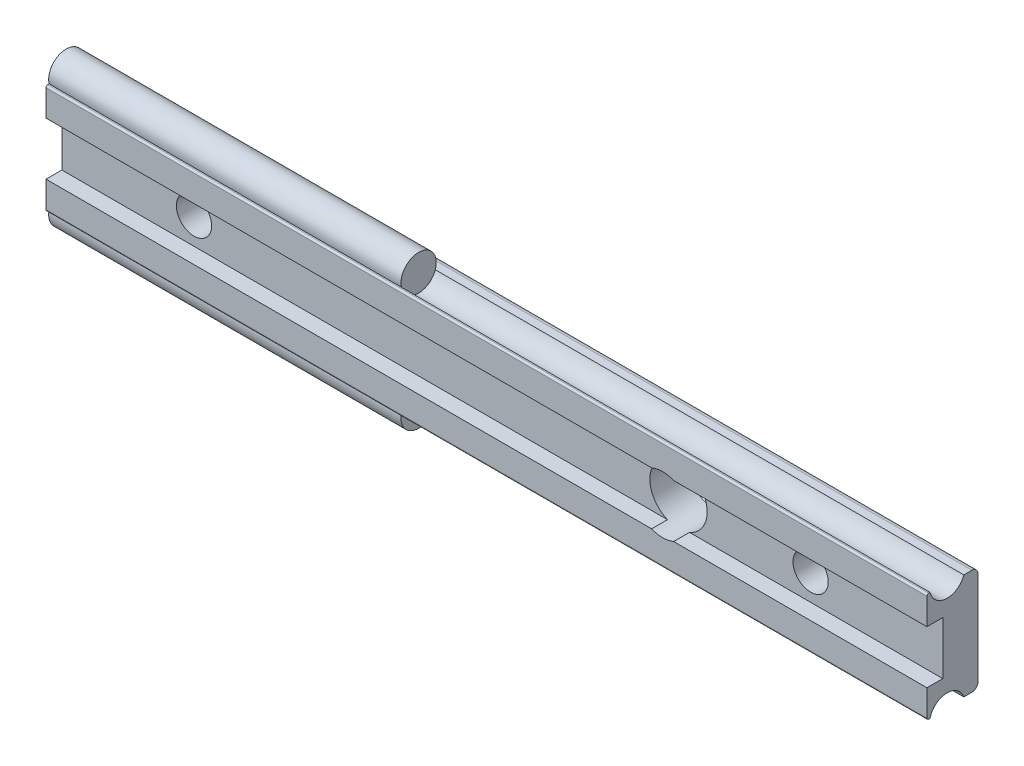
ISO-10303-21;
HEADER;
FILE_DESCRIPTION(('STEP AP214'),'2;1');
FILE_NAME('part.step','',(''),(''),'','','');
FILE_SCHEMA(('AUTOMOTIVE_DESIGN { 1 0 10303 214 1 1 1 1 }'));
ENDSEC;
DATA;
#1=APPLICATION_CONTEXT('core data for automotive mechanical design processes');
#2=APPLICATION_PROTOCOL_DEFINITION('international standard','automotive_design',2000,#1);
#3=PRODUCT_CONTEXT('',#1,'mechanical');
#4=PRODUCT('Part','Part','',(#3));
#5=PRODUCT_RELATED_PRODUCT_CATEGORY('part','',(#4));
#6=PRODUCT_DEFINITION_FORMATION('','',#4);
#7=PRODUCT_DEFINITION_CONTEXT('part definition',#1,'design');
#8=PRODUCT_DEFINITION('design','',#6,#7);
#9=PRODUCT_DEFINITION_SHAPE('','',#8);
#10=(LENGTH_UNIT() NAMED_UNIT(*) SI_UNIT(.MILLI.,.METRE.));
#11=(NAMED_UNIT(*) PLANE_ANGLE_UNIT() SI_UNIT($,.RADIAN.));
#12=(NAMED_UNIT(*) SI_UNIT($,.STERADIAN.) SOLID_ANGLE_UNIT());
#13=UNCERTAINTY_MEASURE_WITH_UNIT(LENGTH_MEASURE(1.E-05),#10,'distance_accuracy_value','');
#14=(GEOMETRIC_REPRESENTATION_CONTEXT(3) GLOBAL_UNCERTAINTY_ASSIGNED_CONTEXT((#13)) GLOBAL_UNIT_ASSIGNED_CONTEXT((#10,
#11,#12)) REPRESENTATION_CONTEXT('',''));
#15=CARTESIAN_POINT('',(0.,0.,0.));
#16=DIRECTION('',(0.,0.,1.));
#17=DIRECTION('',(1.,0.,0.));
#18=AXIS2_PLACEMENT_3D('',#15,#16,#17);
#19=CARTESIAN_POINT('',(-15.,-6.65000008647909,3.5000001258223));
#20=DIRECTION('',(1.,0.,0.));
#21=DIRECTION('',(0.,0.,-1.));
#22=AXIS2_PLACEMENT_3D('',#19,#20,#21);
#23=CYLINDRICAL_SURFACE('',#22,2.00000010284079);
#24=DIRECTION('',(1.,0.,0.));
#25=VECTOR('',#24,1.);
#26=CARTESIAN_POINT('',(-15.,-6.19000011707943,5.4463814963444));
#27=LINE('',#26,#25);
#28=CARTESIAN_POINT('',(25.,-6.19000011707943,5.4463814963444));
#29=VERTEX_POINT('',#28);
#30=CARTESIAN_POINT('',(85.,-6.19000011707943,5.4463814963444));
#31=VERTEX_POINT('',#30);
#32=EDGE_CURVE('E36',#29,#31,#27,.T.);
#33=ORIENTED_EDGE('',*,*,#32,.F.);
#34=CARTESIAN_POINT('',(25.,-6.65000008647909,3.5000001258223));
#35=DIRECTION('',(-1.,0.,0.));
#36=DIRECTION('',(0.,0.,1.));
#37=AXIS2_PLACEMENT_3D('',#34,#35,#36);
#38=CIRCLE('',#37,2.00000010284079);
#39=CARTESIAN_POINT('',(25.,-6.00000004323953,1.60857199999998));
#40=VERTEX_POINT('',#39);
#41=EDGE_CURVE('E31',#29,#40,#38,.T.);
#42=ORIENTED_EDGE('',*,*,#41,.T.);
#43=DIRECTION('',(1.,0.,0.));
#44=VECTOR('',#43,1.);
#45=CARTESIAN_POINT('',(-15.,-6.00000004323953,1.60857199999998));
#46=LINE('',#45,#44);
#47=CARTESIAN_POINT('',(85.,-6.00000004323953,1.60857199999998));
#48=VERTEX_POINT('',#47);
#49=EDGE_CURVE('E181',#40,#48,#46,.T.);
#50=ORIENTED_EDGE('',*,*,#49,.T.);
#51=CARTESIAN_POINT('',(85.,-6.65000008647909,3.5000001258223));
#52=DIRECTION('',(-1.,0.,0.));
#53=DIRECTION('',(0.,0.,1.));
#54=AXIS2_PLACEMENT_3D('',#51,#52,#53);
#55=CIRCLE('',#54,2.00000010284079);
#56=EDGE_CURVE('E263',#31,#48,#55,.T.);
#57=ORIENTED_EDGE('',*,*,#56,.F.);
#58=EDGE_LOOP('',(#33,#42,#50,#57));
#59=FACE_BOUND('',#58,.T.);
#60=ADVANCED_FACE('F14',(#59),#23,.F.);
#61=CARTESIAN_POINT('',(-15.,6.65000008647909,3.5000001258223));
#62=DIRECTION('',(1.,0.,0.));
#63=DIRECTION('',(0.,0.,-1.));
#64=AXIS2_PLACEMENT_3D('',#61,#62,#63);
#65=CYLINDRICAL_SURFACE('',#64,2.00000010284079);
#66=DIRECTION('',(1.,0.,0.));
#67=VECTOR('',#66,1.);
#68=CARTESIAN_POINT('',(-15.,6.00000004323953,1.60857199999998));
#69=LINE('',#68,#67);
#70=CARTESIAN_POINT('',(25.,6.00000004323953,1.60857199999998));
#71=VERTEX_POINT('',#70);
#72=CARTESIAN_POINT('',(85.,6.00000004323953,1.60857199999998));
#73=VERTEX_POINT('',#72);
#74=EDGE_CURVE('E343',#71,#73,#69,.T.);
#75=ORIENTED_EDGE('',*,*,#74,.F.);
#76=CARTESIAN_POINT('',(25.,6.65000008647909,3.5000001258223));
#77=DIRECTION('',(-1.,0.,0.));
#78=DIRECTION('',(0.,0.,1.));
#79=AXIS2_PLACEMENT_3D('',#76,#77,#78);
#80=CIRCLE('',#79,2.00000010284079);
#81=CARTESIAN_POINT('',(25.,6.19000011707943,5.4463814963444));
#82=VERTEX_POINT('',#81);
#83=EDGE_CURVE('E194',#71,#82,#80,.T.);
#84=ORIENTED_EDGE('',*,*,#83,.T.);
#85=DIRECTION('',(1.,0.,0.));
#86=VECTOR('',#85,1.);
#87=CARTESIAN_POINT('',(-15.,6.19000011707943,5.4463814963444));
#88=LINE('',#87,#86);
#89=CARTESIAN_POINT('',(85.,6.19000011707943,5.4463814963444));
#90=VERTEX_POINT('',#89);
#91=EDGE_CURVE('E340',#82,#90,#88,.T.);
#92=ORIENTED_EDGE('',*,*,#91,.T.);
#93=CARTESIAN_POINT('',(85.,6.65000008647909,3.5000001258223));
#94=DIRECTION('',(-1.,0.,0.));
#95=DIRECTION('',(0.,0.,-1.));
#96=AXIS2_PLACEMENT_3D('',#93,#94,#95);
#97=CIRCLE('',#96,2.00000010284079);
#98=EDGE_CURVE('E233',#73,#90,#97,.T.);
#99=ORIENTED_EDGE('',*,*,#98,.F.);
#100=EDGE_LOOP('',(#75,#84,#92,#99));
#101=FACE_BOUND('',#100,.T.);
#102=ADVANCED_FACE('F353',(#101),#65,.F.);
#103=CARTESIAN_POINT('',(-15.,-3.00000011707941,5.79999999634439));
#104=DIRECTION('',(0.,1.,0.));
#105=DIRECTION('',(0.,0.,1.));
#106=AXIS2_PLACEMENT_3D('',#103,#104,#105);
#107=PLANE('',#106);
#108=DIRECTION('',(0.,0.,-1.));
#109=VECTOR('',#108,1.);
#110=CARTESIAN_POINT('',(56.2499997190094,-3.00000011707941,5.7999999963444));
#111=LINE('',#110,#109);
#112=CARTESIAN_POINT('',(56.2499997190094,-3.00000011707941,5.7999999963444));
#113=VERTEX_POINT('',#112);
#114=CARTESIAN_POINT('',(56.2499997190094,-3.00000011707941,3.99999999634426));
#115=VERTEX_POINT('',#114);
#116=EDGE_CURVE('E220',#113,#115,#111,.T.);
#117=ORIENTED_EDGE('',*,*,#116,.F.);
#118=DIRECTION('',(1.,0.,0.));
#119=VECTOR('',#118,1.);
#120=CARTESIAN_POINT('',(-15.,-3.00000011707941,5.79999999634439));
#121=LINE('',#120,#119);
#122=CARTESIAN_POINT('',(85.,-3.00000011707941,5.79999999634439));
#123=VERTEX_POINT('',#122);
#124=EDGE_CURVE('E320',#113,#123,#121,.T.);
#125=ORIENTED_EDGE('',*,*,#124,.T.);
#126=DIRECTION('',(0.,0.,1.));
#127=VECTOR('',#126,1.);
#128=CARTESIAN_POINT('',(85.,-3.00000011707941,5.79999999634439));
#129=LINE('',#128,#127);
#130=CARTESIAN_POINT('',(85.,-3.00000011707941,3.99999999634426));
#131=VERTEX_POINT('',#130);
#132=EDGE_CURVE('E251',#131,#123,#129,.T.);
#133=ORIENTED_EDGE('',*,*,#132,.F.);
#134=DIRECTION('',(1.,0.,0.));
#135=VECTOR('',#134,1.);
#136=CARTESIAN_POINT('',(-15.,-3.00000011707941,3.99999999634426));
#137=LINE('',#136,#135);
#138=EDGE_CURVE('E324',#115,#131,#137,.T.);
#139=ORIENTED_EDGE('',*,*,#138,.F.);
#140=EDGE_LOOP('',(#117,#125,#133,#139));
#141=FACE_BOUND('',#140,.T.);
#142=ADVANCED_FACE('F373',(#141),#107,.T.);
#143=CARTESIAN_POINT('',(-15.,-3.00000011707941,3.99999999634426));
#144=DIRECTION('',(0.,0.,1.));
#145=DIRECTION('',(0.,-1.,0.));
#146=AXIS2_PLACEMENT_3D('',#143,#144,#145);
#147=PLANE('',#146);
#148=CARTESIAN_POINT('',(70.,0.,3.99999999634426));
#149=DIRECTION('',(0.,0.,1.));
#150=DIRECTION('',(0.,-1.,0.));
#151=AXIS2_PLACEMENT_3D('',#148,#149,#150);
#152=CIRCLE('',#151,2.);
#153=CARTESIAN_POINT('',(70.,-2.,3.99999999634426));
#154=VERTEX_POINT('',#153);
#155=EDGE_CURVE('E206',#154,#154,#152,.T.);
#156=ORIENTED_EDGE('',*,*,#155,.F.);
#157=EDGE_LOOP('',(#156));
#158=FACE_BOUND('',#157,.T.);
#159=CARTESIAN_POINT('',(55.,0.,3.99999999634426));
#160=DIRECTION('',(0.,0.,1.));
#161=DIRECTION('',(0.,-1.,0.));
#162=AXIS2_PLACEMENT_3D('',#159,#160,#161);
#163=CIRCLE('',#162,3.25);
#164=CARTESIAN_POINT('',(56.2499997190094,3.00000011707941,3.99999999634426));
#165=VERTEX_POINT('',#164);
#166=EDGE_CURVE('E218',#115,#165,#163,.T.);
#167=ORIENTED_EDGE('',*,*,#166,.F.);
#168=ORIENTED_EDGE('',*,*,#138,.T.);
#169=DIRECTION('',(0.,-1.,0.));
#170=VECTOR('',#169,1.);
#171=CARTESIAN_POINT('',(85.,-3.00000011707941,3.99999999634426));
#172=LINE('',#171,#170);
#173=CARTESIAN_POINT('',(85.,3.00000011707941,3.99999999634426));
#174=VERTEX_POINT('',#173);
#175=EDGE_CURVE('E248',#174,#131,#172,.T.);
#176=ORIENTED_EDGE('',*,*,#175,.F.);
#177=DIRECTION('',(1.,0.,0.));
#178=VECTOR('',#177,1.);
#179=CARTESIAN_POINT('',(-15.,3.00000011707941,3.99999999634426));
#180=LINE('',#179,#178);
#181=EDGE_CURVE('E328',#165,#174,#180,.T.);
#182=ORIENTED_EDGE('',*,*,#181,.F.);
#183=EDGE_LOOP('',(#167,#168,#176,#182));
#184=FACE_BOUND('',#183,.T.);
#185=ADVANCED_FACE('F399',(#158,#184),#147,.T.);
#186=CARTESIAN_POINT('',(-15.,3.00000011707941,5.7999999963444));
#187=DIRECTION('',(0.,-1.,0.));
#188=DIRECTION('',(0.,0.,-1.));
#189=AXIS2_PLACEMENT_3D('',#186,#187,#188);
#190=PLANE('',#189);
#191=DIRECTION('',(0.,0.,-1.));
#192=VECTOR('',#191,1.);
#193=CARTESIAN_POINT('',(53.7500002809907,3.00000011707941,5.7999999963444));
#194=LINE('',#193,#192);
#195=CARTESIAN_POINT('',(53.7500002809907,3.00000011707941,5.7999999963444));
#196=VERTEX_POINT('',#195);
#197=CARTESIAN_POINT('',(53.7500002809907,3.00000011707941,3.99999999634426));
#198=VERTEX_POINT('',#197);
#199=EDGE_CURVE('E223',#196,#198,#194,.T.);
#200=ORIENTED_EDGE('',*,*,#199,.F.);
#201=DIRECTION('',(1.,0.,0.));
#202=VECTOR('',#201,1.);
#203=CARTESIAN_POINT('',(-15.,3.00000011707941,5.7999999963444));
#204=LINE('',#203,#202);
#205=CARTESIAN_POINT('',(-15.,3.00000011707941,5.7999999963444));
#206=VERTEX_POINT('',#205);
#207=EDGE_CURVE('E329',#206,#196,#204,.T.);
#208=ORIENTED_EDGE('',*,*,#207,.F.);
#209=DIRECTION('',(0.,0.,-1.));
#210=VECTOR('',#209,1.);
#211=CARTESIAN_POINT('',(-15.,3.00000011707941,5.7999999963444));
#212=LINE('',#211,#210);
#213=CARTESIAN_POINT('',(-15.,3.00000011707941,3.99999999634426));
#214=VERTEX_POINT('',#213);
#215=EDGE_CURVE('E289',#206,#214,#212,.T.);
#216=ORIENTED_EDGE('',*,*,#215,.T.);
#217=EDGE_CURVE('E325',#214,#198,#180,.T.);
#218=ORIENTED_EDGE('',*,*,#217,.T.);
#219=EDGE_LOOP('',(#200,#208,#216,#218));
#220=FACE_BOUND('',#219,.T.);
#221=ADVANCED_FACE('F404',(#220),#190,.T.);
#222=CARTESIAN_POINT('',(-15.,5.30000004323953,0.7));
#223=DIRECTION('',(1.,0.,0.));
#224=DIRECTION('',(0.,0.,-1.));
#225=AXIS2_PLACEMENT_3D('',#222,#223,#224);
#226=CYLINDRICAL_SURFACE('',#225,0.7);
#227=CARTESIAN_POINT('',(85.,5.30000004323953,0.7));
#228=DIRECTION('',(1.,0.,0.));
#229=DIRECTION('',(0.,0.,-1.));
#230=AXIS2_PLACEMENT_3D('',#227,#228,#229);
#231=CIRCLE('',#230,0.7);
#232=CARTESIAN_POINT('',(85.,5.30000004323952,0.));
#233=VERTEX_POINT('',#232);
#234=CARTESIAN_POINT('',(85.,6.00000004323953,0.7));
#235=VERTEX_POINT('',#234);
#236=EDGE_CURVE('E227',#233,#235,#231,.T.);
#237=ORIENTED_EDGE('',*,*,#236,.F.);
#238=DIRECTION('',(1.,0.,0.));
#239=VECTOR('',#238,1.);
#240=CARTESIAN_POINT('',(-15.,5.30000004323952,0.));
#241=LINE('',#240,#239);
#242=CARTESIAN_POINT('',(-15.,5.30000004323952,0.));
#243=VERTEX_POINT('',#242);
#244=EDGE_CURVE('E9',#243,#233,#241,.T.);
#245=ORIENTED_EDGE('',*,*,#244,.F.);
#246=CARTESIAN_POINT('',(-15.,5.30000004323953,0.7));
#247=DIRECTION('',(1.,0.,0.));
#248=DIRECTION('',(0.,0.,-1.));
#249=AXIS2_PLACEMENT_3D('',#246,#247,#248);
#250=CIRCLE('',#249,0.7);
#251=CARTESIAN_POINT('',(-15.,6.00000004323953,0.7));
#252=VERTEX_POINT('',#251);
#253=EDGE_CURVE('E275',#243,#252,#250,.T.);
#254=ORIENTED_EDGE('',*,*,#253,.T.);
#255=DIRECTION('',(1.,0.,0.));
#256=VECTOR('',#255,1.);
#257=CARTESIAN_POINT('',(-15.,6.00000004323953,0.7));
#258=LINE('',#257,#256);
#259=EDGE_CURVE('E308',#252,#235,#258,.T.);
#260=ORIENTED_EDGE('',*,*,#259,.T.);
#261=EDGE_LOOP('',(#237,#245,#254,#260));
#262=FACE_BOUND('',#261,.T.);
#263=ADVANCED_FACE('F16',(#262),#226,.T.);
#264=CARTESIAN_POINT('',(-15.,-5.30000004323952,0.));
#265=DIRECTION('',(0.,0.,-1.));
#266=DIRECTION('',(-1.,0.,0.));
#267=AXIS2_PLACEMENT_3D('',#264,#265,#266);
#268=PLANE('',#267);
#269=CARTESIAN_POINT('',(0.,0.,0.));
#270=DIRECTION('',(0.,0.,-1.));
#271=DIRECTION('',(-1.,0.,0.));
#272=AXIS2_PLACEMENT_3D('',#269,#270,#271);
#273=CIRCLE('',#272,2.);
#274=CARTESIAN_POINT('',(-2.,0.,0.));
#275=VERTEX_POINT('',#274);
#276=EDGE_CURVE('E201',#275,#275,#273,.T.);
#277=ORIENTED_EDGE('',*,*,#276,.F.);
#278=EDGE_LOOP('',(#277));
#279=FACE_BOUND('',#278,.T.);
#280=CARTESIAN_POINT('',(70.,0.,0.));
#281=DIRECTION('',(0.,0.,-1.));
#282=DIRECTION('',(-1.,0.,0.));
#283=AXIS2_PLACEMENT_3D('',#280,#281,#282);
#284=CIRCLE('',#283,2.);
#285=CARTESIAN_POINT('',(68.,0.,0.));
#286=VERTEX_POINT('',#285);
#287=EDGE_CURVE('E196',#286,#286,#284,.T.);
#288=ORIENTED_EDGE('',*,*,#287,.F.);
#289=EDGE_LOOP('',(#288));
#290=FACE_BOUND('',#289,.T.);
#291=CARTESIAN_POINT('',(55.,0.,0.));
#292=DIRECTION('',(0.,0.,-1.));
#293=DIRECTION('',(-1.,0.,0.));
#294=AXIS2_PLACEMENT_3D('',#291,#292,#293);
#295=CIRCLE('',#294,3.25);
#296=CARTESIAN_POINT('',(51.75,0.,0.));
#297=VERTEX_POINT('',#296);
#298=EDGE_CURVE('E209',#297,#297,#295,.T.);
#299=ORIENTED_EDGE('',*,*,#298,.F.);
#300=EDGE_LOOP('',(#299));
#301=FACE_BOUND('',#300,.T.);
#302=DIRECTION('',(0.,1.,0.));
#303=VECTOR('',#302,1.);
#304=CARTESIAN_POINT('',(85.,-5.30000004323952,0.));
#305=LINE('',#304,#303);
#306=CARTESIAN_POINT('',(85.,-5.30000004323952,0.));
#307=VERTEX_POINT('',#306);
#308=EDGE_CURVE('E272',#307,#233,#305,.T.);
#309=ORIENTED_EDGE('',*,*,#308,.F.);
#310=DIRECTION('',(1.,0.,0.));
#311=VECTOR('',#310,1.);
#312=CARTESIAN_POINT('',(-15.,-5.30000004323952,0.));
#313=LINE('',#312,#311);
#314=CARTESIAN_POINT('',(-15.,-5.30000004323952,0.));
#315=VERTEX_POINT('',#314);
#316=EDGE_CURVE('E23',#315,#307,#313,.T.);
#317=ORIENTED_EDGE('',*,*,#316,.F.);
#318=DIRECTION('',(0.,1.,0.));
#319=VECTOR('',#318,1.);
#320=CARTESIAN_POINT('',(-15.,-5.30000004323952,0.));
#321=LINE('',#320,#319);
#322=EDGE_CURVE('E306',#315,#243,#321,.T.);
#323=ORIENTED_EDGE('',*,*,#322,.T.);
#324=ORIENTED_EDGE('',*,*,#244,.T.);
#325=EDGE_LOOP('',(#309,#317,#323,#324));
#326=FACE_BOUND('',#325,.T.);
#327=ADVANCED_FACE('F361',(#279,#290,#301,#326),#268,.T.);
#328=CARTESIAN_POINT('',(-15.,-5.30000004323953,0.7));
#329=DIRECTION('',(1.,0.,0.));
#330=DIRECTION('',(0.,0.,-1.));
#331=AXIS2_PLACEMENT_3D('',#328,#329,#330);
#332=CYLINDRICAL_SURFACE('',#331,0.7);
#333=CARTESIAN_POINT('',(85.,-5.30000004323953,0.7));
#334=DIRECTION('',(1.,0.,0.));
#335=DIRECTION('',(0.,0.,1.));
#336=AXIS2_PLACEMENT_3D('',#333,#334,#335);
#337=CIRCLE('',#336,0.7);
#338=CARTESIAN_POINT('',(85.,-6.00000004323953,0.7));
#339=VERTEX_POINT('',#338);
#340=EDGE_CURVE('E269',#339,#307,#337,.T.);
#341=ORIENTED_EDGE('',*,*,#340,.F.);
#342=DIRECTION('',(1.,0.,0.));
#343=VECTOR('',#342,1.);
#344=CARTESIAN_POINT('',(-15.,-6.00000004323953,0.7));
#345=LINE('',#344,#343);
#346=CARTESIAN_POINT('',(-15.,-6.00000004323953,0.7));
#347=VERTEX_POINT('',#346);
#348=EDGE_CURVE('E185',#347,#339,#345,.T.);
#349=ORIENTED_EDGE('',*,*,#348,.F.);
#350=CARTESIAN_POINT('',(-15.,-5.30000004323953,0.7));
#351=DIRECTION('',(1.,0.,0.));
#352=DIRECTION('',(0.,0.,1.));
#353=AXIS2_PLACEMENT_3D('',#350,#351,#352);
#354=CIRCLE('',#353,0.7);
#355=EDGE_CURVE('E173',#347,#315,#354,.T.);
#356=ORIENTED_EDGE('',*,*,#355,.T.);
#357=ORIENTED_EDGE('',*,*,#316,.T.);
#358=EDGE_LOOP('',(#341,#349,#356,#357));
#359=FACE_BOUND('',#358,.T.);
#360=ADVANCED_FACE('F364',(#359),#332,.T.);
#361=CARTESIAN_POINT('',(-15.,-6.00000004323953,1.60857199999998));
#362=DIRECTION('',(0.,-1.,0.));
#363=DIRECTION('',(-1.,0.,0.));
#364=AXIS2_PLACEMENT_3D('',#361,#362,#363);
#365=PLANE('',#364);
#366=DIRECTION('',(0.,0.,-1.));
#367=VECTOR('',#366,1.);
#368=CARTESIAN_POINT('',(85.,-6.00000004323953,1.60857199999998));
#369=LINE('',#368,#367);
#370=EDGE_CURVE('E266',#48,#339,#369,.T.);
#371=ORIENTED_EDGE('',*,*,#370,.F.);
#372=ORIENTED_EDGE('',*,*,#49,.F.);
#373=CARTESIAN_POINT('',(-15.,-6.00000004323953,1.60857199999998));
#374=VERTEX_POINT('',#373);
#375=EDGE_CURVE('E178',#374,#40,#46,.T.);
#376=ORIENTED_EDGE('',*,*,#375,.F.);
#377=DIRECTION('',(0.,0.,-1.));
#378=VECTOR('',#377,1.);
#379=CARTESIAN_POINT('',(-15.,-6.00000004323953,1.60857199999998));
#380=LINE('',#379,#378);
#381=EDGE_CURVE('E164',#374,#347,#380,.T.);
#382=ORIENTED_EDGE('',*,*,#381,.T.);
#383=ORIENTED_EDGE('',*,*,#348,.T.);
#384=EDGE_LOOP('',(#371,#372,#376,#382,#383));
#385=FACE_BOUND('',#384,.T.);
#386=ADVANCED_FACE('F180',(#385),#365,.T.);
#387=CARTESIAN_POINT('',(-15.,-6.19000011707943,5.4463814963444));
#388=DIRECTION('',(0.,-1.,0.));
#389=DIRECTION('',(-1.,0.,0.));
#390=AXIS2_PLACEMENT_3D('',#387,#388,#389);
#391=PLANE('',#390);
#392=DIRECTION('',(0.,0.,-1.));
#393=VECTOR('',#392,1.);
#394=CARTESIAN_POINT('',(85.,-6.19000011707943,5.4463814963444));
#395=LINE('',#394,#393);
#396=CARTESIAN_POINT('',(85.,-6.19000011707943,5.59999999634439));
#397=VERTEX_POINT('',#396);
#398=EDGE_CURVE('E260',#397,#31,#395,.T.);
#399=ORIENTED_EDGE('',*,*,#398,.F.);
#400=DIRECTION('',(1.,0.,0.));
#401=VECTOR('',#400,1.);
#402=CARTESIAN_POINT('',(-15.,-6.19000011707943,5.59999999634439));
#403=LINE('',#402,#401);
#404=CARTESIAN_POINT('',(-15.,-6.19000011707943,5.59999999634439));
#405=VERTEX_POINT('',#404);
#406=EDGE_CURVE('E313',#405,#397,#403,.T.);
#407=ORIENTED_EDGE('',*,*,#406,.F.);
#408=DIRECTION('',(0.,0.,-1.));
#409=VECTOR('',#408,1.);
#410=CARTESIAN_POINT('',(-15.,-6.19000011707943,5.4463814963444));
#411=LINE('',#410,#409);
#412=CARTESIAN_POINT('',(-15.,-6.19000011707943,5.4463814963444));
#413=VERTEX_POINT('',#412);
#414=EDGE_CURVE('E175',#405,#413,#411,.T.);
#415=ORIENTED_EDGE('',*,*,#414,.T.);
#416=EDGE_CURVE('E189',#413,#29,#27,.T.);
#417=ORIENTED_EDGE('',*,*,#416,.T.);
#418=ORIENTED_EDGE('',*,*,#32,.T.);
#419=EDGE_LOOP('',(#399,#407,#415,#417,#418));
#420=FACE_BOUND('',#419,.T.);
#421=ADVANCED_FACE('F378',(#420),#391,.T.);
#422=CARTESIAN_POINT('',(-15.,-5.99000011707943,5.59999999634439));
#423=DIRECTION('',(1.,0.,0.));
#424=DIRECTION('',(0.,0.,-1.));
#425=AXIS2_PLACEMENT_3D('',#422,#423,#424);
#426=CYLINDRICAL_SURFACE('',#425,0.2);
#427=CARTESIAN_POINT('',(85.,-5.99000011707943,5.59999999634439));
#428=DIRECTION('',(1.,0.,0.));
#429=DIRECTION('',(0.,0.,-1.));
#430=AXIS2_PLACEMENT_3D('',#427,#428,#429);
#431=CIRCLE('',#430,0.2);
#432=CARTESIAN_POINT('',(85.,-5.99000011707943,5.79999999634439));
#433=VERTEX_POINT('',#432);
#434=EDGE_CURVE('E257',#433,#397,#431,.T.);
#435=ORIENTED_EDGE('',*,*,#434,.F.);
#436=DIRECTION('',(1.,0.,0.));
#437=VECTOR('',#436,1.);
#438=CARTESIAN_POINT('',(-15.,-5.99000011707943,5.79999999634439));
#439=LINE('',#438,#437);
#440=CARTESIAN_POINT('',(-15.,-5.99000011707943,5.79999999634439));
#441=VERTEX_POINT('',#440);
#442=EDGE_CURVE('E315',#441,#433,#439,.T.);
#443=ORIENTED_EDGE('',*,*,#442,.F.);
#444=CARTESIAN_POINT('',(-15.,-5.99000011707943,5.59999999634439));
#445=DIRECTION('',(1.,0.,0.));
#446=DIRECTION('',(0.,0.,-1.));
#447=AXIS2_PLACEMENT_3D('',#444,#445,#446);
#448=CIRCLE('',#447,0.2);
#449=EDGE_CURVE('E301',#441,#405,#448,.T.);
#450=ORIENTED_EDGE('',*,*,#449,.T.);
#451=ORIENTED_EDGE('',*,*,#406,.T.);
#452=EDGE_LOOP('',(#435,#443,#450,#451));
#453=FACE_BOUND('',#452,.T.);
#454=ADVANCED_FACE('F381',(#453),#426,.T.);
#455=CARTESIAN_POINT('',(-15.,-3.00000011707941,5.79999999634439));
#456=DIRECTION('',(0.,0.,1.));
#457=DIRECTION('',(1.,0.,0.));
#458=AXIS2_PLACEMENT_3D('',#455,#456,#457);
#459=PLANE('',#458);
#460=CARTESIAN_POINT('',(55.,0.,5.7999999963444));
#461=DIRECTION('',(0.,0.,-1.));
#462=DIRECTION('',(-1.,0.,0.));
#463=AXIS2_PLACEMENT_3D('',#460,#461,#462);
#464=CIRCLE('',#463,3.25);
#465=CARTESIAN_POINT('',(53.7500002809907,-3.00000011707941,5.7999999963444));
#466=VERTEX_POINT('',#465);
#467=EDGE_CURVE('E212',#113,#466,#464,.T.);
#468=ORIENTED_EDGE('',*,*,#467,.T.);
#469=CARTESIAN_POINT('',(-15.,-3.00000011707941,5.79999999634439));
#470=VERTEX_POINT('',#469);
#471=EDGE_CURVE('E317',#470,#466,#121,.T.);
#472=ORIENTED_EDGE('',*,*,#471,.F.);
#473=DIRECTION('',(0.,-1.,0.));
#474=VECTOR('',#473,1.);
#475=CARTESIAN_POINT('',(-15.,-3.00000011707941,5.79999999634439));
#476=LINE('',#475,#474);
#477=EDGE_CURVE('E298',#470,#441,#476,.T.);
#478=ORIENTED_EDGE('',*,*,#477,.T.);
#479=ORIENTED_EDGE('',*,*,#442,.T.);
#480=DIRECTION('',(0.,-1.,0.));
#481=VECTOR('',#480,1.);
#482=CARTESIAN_POINT('',(85.,-3.00000011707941,5.79999999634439));
#483=LINE('',#482,#481);
#484=EDGE_CURVE('E254',#123,#433,#483,.T.);
#485=ORIENTED_EDGE('',*,*,#484,.F.);
#486=ORIENTED_EDGE('',*,*,#124,.F.);
#487=EDGE_LOOP('',(#468,#472,#478,#479,#485,#486));
#488=FACE_BOUND('',#487,.T.);
#489=ADVANCED_FACE('F385',(#488),#459,.T.);
#490=DIRECTION('',(0.,0.,-1.));
#491=VECTOR('',#490,1.);
#492=CARTESIAN_POINT('',(53.7500002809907,-3.00000011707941,5.7999999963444));
#493=LINE('',#492,#491);
#494=CARTESIAN_POINT('',(53.7500002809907,-3.00000011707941,3.99999999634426));
#495=VERTEX_POINT('',#494);
#496=EDGE_CURVE('E225',#495,#466,#493,.F.);
#497=ORIENTED_EDGE('',*,*,#496,.F.);
#498=CARTESIAN_POINT('',(-15.,-3.00000011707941,3.99999999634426));
#499=VERTEX_POINT('',#498);
#500=EDGE_CURVE('E321',#499,#495,#137,.T.);
#501=ORIENTED_EDGE('',*,*,#500,.F.);
#502=DIRECTION('',(0.,0.,1.));
#503=VECTOR('',#502,1.);
#504=CARTESIAN_POINT('',(-15.,-3.00000011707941,5.79999999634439));
#505=LINE('',#504,#503);
#506=EDGE_CURVE('E295',#499,#470,#505,.T.);
#507=ORIENTED_EDGE('',*,*,#506,.T.);
#508=ORIENTED_EDGE('',*,*,#471,.T.);
#509=EDGE_LOOP('',(#497,#501,#507,#508));
#510=FACE_BOUND('',#509,.T.);
#511=ADVANCED_FACE('F389',(#510),#107,.T.);
#512=CARTESIAN_POINT('',(0.,0.,3.99999999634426));
#513=DIRECTION('',(0.,0.,1.));
#514=DIRECTION('',(0.,-1.,0.));
#515=AXIS2_PLACEMENT_3D('',#512,#513,#514);
#516=CIRCLE('',#515,2.);
#517=CARTESIAN_POINT('',(0.,-2.,3.99999999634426));
#518=VERTEX_POINT('',#517);
#519=EDGE_CURVE('E18',#518,#518,#516,.T.);
#520=ORIENTED_EDGE('',*,*,#519,.F.);
#521=EDGE_LOOP('',(#520));
#522=FACE_BOUND('',#521,.T.);
#523=EDGE_CURVE('E221',#198,#495,#163,.T.);
#524=ORIENTED_EDGE('',*,*,#523,.F.);
#525=ORIENTED_EDGE('',*,*,#217,.F.);
#526=DIRECTION('',(0.,-1.,0.));
#527=VECTOR('',#526,1.);
#528=CARTESIAN_POINT('',(-15.,-3.00000011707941,3.99999999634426));
#529=LINE('',#528,#527);
#530=EDGE_CURVE('E292',#214,#499,#529,.T.);
#531=ORIENTED_EDGE('',*,*,#530,.T.);
#532=ORIENTED_EDGE('',*,*,#500,.T.);
#533=EDGE_LOOP('',(#524,#525,#531,#532));
#534=FACE_BOUND('',#533,.T.);
#535=ADVANCED_FACE('F393',(#522,#534),#147,.T.);
#536=DIRECTION('',(0.,0.,-1.));
#537=VECTOR('',#536,1.);
#538=CARTESIAN_POINT('',(56.2499997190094,3.00000011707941,5.7999999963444));
#539=LINE('',#538,#537);
#540=CARTESIAN_POINT('',(56.2499997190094,3.00000011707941,5.7999999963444));
#541=VERTEX_POINT('',#540);
#542=EDGE_CURVE('E216',#165,#541,#539,.F.);
#543=ORIENTED_EDGE('',*,*,#542,.F.);
#544=ORIENTED_EDGE('',*,*,#181,.T.);
#545=DIRECTION('',(0.,0.,-1.));
#546=VECTOR('',#545,1.);
#547=CARTESIAN_POINT('',(85.,3.00000011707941,5.7999999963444));
#548=LINE('',#547,#546);
#549=CARTESIAN_POINT('',(85.,3.00000011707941,5.7999999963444));
#550=VERTEX_POINT('',#549);
#551=EDGE_CURVE('E245',#550,#174,#548,.T.);
#552=ORIENTED_EDGE('',*,*,#551,.F.);
#553=EDGE_CURVE('E332',#541,#550,#204,.T.);
#554=ORIENTED_EDGE('',*,*,#553,.F.);
#555=EDGE_LOOP('',(#543,#544,#552,#554));
#556=FACE_BOUND('',#555,.T.);
#557=ADVANCED_FACE('F397',(#556),#190,.T.);
#558=CARTESIAN_POINT('',(-15.,3.00000011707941,5.7999999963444));
#559=DIRECTION('',(0.,0.,1.));
#560=DIRECTION('',(1.,0.,0.));
#561=AXIS2_PLACEMENT_3D('',#558,#559,#560);
#562=PLANE('',#561);
#563=EDGE_CURVE('E213',#196,#541,#464,.T.);
#564=ORIENTED_EDGE('',*,*,#563,.T.);
#565=ORIENTED_EDGE('',*,*,#553,.T.);
#566=DIRECTION('',(0.,-1.,0.));
#567=VECTOR('',#566,1.);
#568=CARTESIAN_POINT('',(85.,3.00000011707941,5.7999999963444));
#569=LINE('',#568,#567);
#570=CARTESIAN_POINT('',(85.,5.99000011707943,5.7999999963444));
#571=VERTEX_POINT('',#570);
#572=EDGE_CURVE('E242',#571,#550,#569,.T.);
#573=ORIENTED_EDGE('',*,*,#572,.F.);
#574=DIRECTION('',(1.,0.,0.));
#575=VECTOR('',#574,1.);
#576=CARTESIAN_POINT('',(-15.,5.99000011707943,5.7999999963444));
#577=LINE('',#576,#575);
#578=CARTESIAN_POINT('',(-15.,5.99000011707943,5.7999999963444));
#579=VERTEX_POINT('',#578);
#580=EDGE_CURVE('E333',#579,#571,#577,.T.);
#581=ORIENTED_EDGE('',*,*,#580,.F.);
#582=DIRECTION('',(0.,-1.,0.));
#583=VECTOR('',#582,1.);
#584=CARTESIAN_POINT('',(-15.,3.00000011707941,5.7999999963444));
#585=LINE('',#584,#583);
#586=EDGE_CURVE('E286',#579,#206,#585,.T.);
#587=ORIENTED_EDGE('',*,*,#586,.T.);
#588=ORIENTED_EDGE('',*,*,#207,.T.);
#589=EDGE_LOOP('',(#564,#565,#573,#581,#587,#588));
#590=FACE_BOUND('',#589,.T.);
#591=ADVANCED_FACE('F402',(#590),#562,.T.);
#592=CARTESIAN_POINT('',(-15.,5.99000011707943,5.5999999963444));
#593=DIRECTION('',(1.,0.,0.));
#594=DIRECTION('',(0.,0.,-1.));
#595=AXIS2_PLACEMENT_3D('',#592,#593,#594);
#596=CYLINDRICAL_SURFACE('',#595,0.2);
#597=CARTESIAN_POINT('',(85.,5.99000011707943,5.5999999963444));
#598=DIRECTION('',(1.,0.,0.));
#599=DIRECTION('',(0.,0.,1.));
#600=AXIS2_PLACEMENT_3D('',#597,#598,#599);
#601=CIRCLE('',#600,0.2);
#602=CARTESIAN_POINT('',(85.,6.19000011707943,5.5999999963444));
#603=VERTEX_POINT('',#602);
#604=EDGE_CURVE('E239',#603,#571,#601,.T.);
#605=ORIENTED_EDGE('',*,*,#604,.F.);
#606=DIRECTION('',(1.,0.,0.));
#607=VECTOR('',#606,1.);
#608=CARTESIAN_POINT('',(-15.,6.19000011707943,5.5999999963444));
#609=LINE('',#608,#607);
#610=CARTESIAN_POINT('',(-15.,6.19000011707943,5.5999999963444));
#611=VERTEX_POINT('',#610);
#612=EDGE_CURVE('E335',#611,#603,#609,.T.);
#613=ORIENTED_EDGE('',*,*,#612,.F.);
#614=CARTESIAN_POINT('',(-15.,5.99000011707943,5.5999999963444));
#615=DIRECTION('',(1.,0.,0.));
#616=DIRECTION('',(0.,0.,1.));
#617=AXIS2_PLACEMENT_3D('',#614,#615,#616);
#618=CIRCLE('',#617,0.2);
#619=EDGE_CURVE('E283',#611,#579,#618,.T.);
#620=ORIENTED_EDGE('',*,*,#619,.T.);
#621=ORIENTED_EDGE('',*,*,#580,.T.);
#622=EDGE_LOOP('',(#605,#613,#620,#621));
#623=FACE_BOUND('',#622,.T.);
#624=ADVANCED_FACE('F407',(#623),#596,.T.);
#625=CARTESIAN_POINT('',(-15.,6.19000011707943,5.4463814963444));
#626=DIRECTION('',(0.,1.,0.));
#627=DIRECTION('',(1.,0.,0.));
#628=AXIS2_PLACEMENT_3D('',#625,#626,#627);
#629=PLANE('',#628);
#630=DIRECTION('',(0.,0.,1.));
#631=VECTOR('',#630,1.);
#632=CARTESIAN_POINT('',(85.,6.19000011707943,5.4463814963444));
#633=LINE('',#632,#631);
#634=EDGE_CURVE('E236',#90,#603,#633,.T.);
#635=ORIENTED_EDGE('',*,*,#634,.F.);
#636=ORIENTED_EDGE('',*,*,#91,.F.);
#637=CARTESIAN_POINT('',(-15.,6.19000011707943,5.4463814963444));
#638=VERTEX_POINT('',#637);
#639=EDGE_CURVE('E337',#638,#82,#88,.T.);
#640=ORIENTED_EDGE('',*,*,#639,.F.);
#641=DIRECTION('',(0.,0.,1.));
#642=VECTOR('',#641,1.);
#643=CARTESIAN_POINT('',(-15.,6.19000011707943,5.4463814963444));
#644=LINE('',#643,#642);
#645=EDGE_CURVE('E280',#638,#611,#644,.T.);
#646=ORIENTED_EDGE('',*,*,#645,.T.);
#647=ORIENTED_EDGE('',*,*,#612,.T.);
#648=EDGE_LOOP('',(#635,#636,#640,#646,#647));
#649=FACE_BOUND('',#648,.T.);
#650=ADVANCED_FACE('F411',(#649),#629,.T.);
#651=CARTESIAN_POINT('',(-15.,6.00000004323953,1.60857199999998));
#652=DIRECTION('',(0.,1.,0.));
#653=DIRECTION('',(1.,0.,0.));
#654=AXIS2_PLACEMENT_3D('',#651,#652,#653);
#655=PLANE('',#654);
#656=DIRECTION('',(0.,0.,1.));
#657=VECTOR('',#656,1.);
#658=CARTESIAN_POINT('',(85.,6.00000004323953,1.60857199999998));
#659=LINE('',#658,#657);
#660=EDGE_CURVE('E230',#235,#73,#659,.T.);
#661=ORIENTED_EDGE('',*,*,#660,.F.);
#662=ORIENTED_EDGE('',*,*,#259,.F.);
#663=DIRECTION('',(0.,0.,1.));
#664=VECTOR('',#663,1.);
#665=CARTESIAN_POINT('',(-15.,6.00000004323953,1.60857199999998));
#666=LINE('',#665,#664);
#667=CARTESIAN_POINT('',(-15.,6.00000004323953,1.60857199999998));
#668=VERTEX_POINT('',#667);
#669=EDGE_CURVE('E278',#252,#668,#666,.T.);
#670=ORIENTED_EDGE('',*,*,#669,.T.);
#671=EDGE_CURVE('E341',#668,#71,#69,.T.);
#672=ORIENTED_EDGE('',*,*,#671,.T.);
#673=ORIENTED_EDGE('',*,*,#74,.T.);
#674=EDGE_LOOP('',(#661,#662,#670,#672,#673));
#675=FACE_BOUND('',#674,.T.);
#676=ADVANCED_FACE('F349',(#675),#655,.T.);
#677=CARTESIAN_POINT('',(-15.,5.30000004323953,0.7));
#678=DIRECTION('',(1.,0.,0.));
#679=DIRECTION('',(0.,0.,-1.));
#680=AXIS2_PLACEMENT_3D('',#677,#678,#679);
#681=PLANE('',#680);
#682=ORIENTED_EDGE('',*,*,#253,.F.);
#683=ORIENTED_EDGE('',*,*,#322,.F.);
#684=ORIENTED_EDGE('',*,*,#355,.F.);
#685=ORIENTED_EDGE('',*,*,#381,.F.);
#686=CARTESIAN_POINT('',(-15.,-6.65000008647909,3.5000001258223));
#687=DIRECTION('',(-1.,0.,0.));
#688=DIRECTION('',(0.,0.,1.));
#689=AXIS2_PLACEMENT_3D('',#686,#687,#688);
#690=CIRCLE('',#689,2.00000010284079);
#691=EDGE_CURVE('E170',#374,#413,#690,.T.);
#692=ORIENTED_EDGE('',*,*,#691,.T.);
#693=ORIENTED_EDGE('',*,*,#414,.F.);
#694=ORIENTED_EDGE('',*,*,#449,.F.);
#695=ORIENTED_EDGE('',*,*,#477,.F.);
#696=ORIENTED_EDGE('',*,*,#506,.F.);
#697=ORIENTED_EDGE('',*,*,#530,.F.);
#698=ORIENTED_EDGE('',*,*,#215,.F.);
#699=ORIENTED_EDGE('',*,*,#586,.F.);
#700=ORIENTED_EDGE('',*,*,#619,.F.);
#701=ORIENTED_EDGE('',*,*,#645,.F.);
#702=CARTESIAN_POINT('',(-15.,6.65000008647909,3.5000001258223));
#703=DIRECTION('',(-1.,0.,0.));
#704=DIRECTION('',(0.,0.,1.));
#705=AXIS2_PLACEMENT_3D('',#702,#703,#704);
#706=CIRCLE('',#705,2.00000010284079);
#707=EDGE_CURVE('E198',#638,#668,#706,.T.);
#708=ORIENTED_EDGE('',*,*,#707,.T.);
#709=ORIENTED_EDGE('',*,*,#669,.F.);
#710=EDGE_LOOP('',(#682,#683,#684,#685,#692,#693,#694,#695,#696,#697,#698,#699,#700,#701,#708,#709));
#711=FACE_BOUND('',#710,.T.);
#712=ADVANCED_FACE('F167',(#711),#681,.F.);
#713=CARTESIAN_POINT('',(85.,5.30000004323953,0.7));
#714=DIRECTION('',(1.,0.,0.));
#715=DIRECTION('',(0.,0.,-1.));
#716=AXIS2_PLACEMENT_3D('',#713,#714,#715);
#717=PLANE('',#716);
#718=ORIENTED_EDGE('',*,*,#236,.T.);
#719=ORIENTED_EDGE('',*,*,#660,.T.);
#720=ORIENTED_EDGE('',*,*,#98,.T.);
#721=ORIENTED_EDGE('',*,*,#634,.T.);
#722=ORIENTED_EDGE('',*,*,#604,.T.);
#723=ORIENTED_EDGE('',*,*,#572,.T.);
#724=ORIENTED_EDGE('',*,*,#551,.T.);
#725=ORIENTED_EDGE('',*,*,#175,.T.);
#726=ORIENTED_EDGE('',*,*,#132,.T.);
#727=ORIENTED_EDGE('',*,*,#484,.T.);
#728=ORIENTED_EDGE('',*,*,#434,.T.);
#729=ORIENTED_EDGE('',*,*,#398,.T.);
#730=ORIENTED_EDGE('',*,*,#56,.T.);
#731=ORIENTED_EDGE('',*,*,#370,.T.);
#732=ORIENTED_EDGE('',*,*,#340,.T.);
#733=ORIENTED_EDGE('',*,*,#308,.T.);
#734=EDGE_LOOP('',(#718,#719,#720,#721,#722,#723,#724,#725,#726,#727,#728,#729,#730,#731,#732,#733));
#735=FACE_BOUND('',#734,.T.);
#736=ADVANCED_FACE('F357',(#735),#717,.T.);
#737=CARTESIAN_POINT('',(55.,0.,5.7999999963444));
#738=DIRECTION('',(0.,0.,-1.));
#739=DIRECTION('',(-1.,0.,0.));
#740=AXIS2_PLACEMENT_3D('',#737,#738,#739);
#741=CYLINDRICAL_SURFACE('',#740,3.25);
#742=ORIENTED_EDGE('',*,*,#496,.T.);
#743=ORIENTED_EDGE('',*,*,#467,.F.);
#744=ORIENTED_EDGE('',*,*,#116,.T.);
#745=ORIENTED_EDGE('',*,*,#166,.T.);
#746=ORIENTED_EDGE('',*,*,#542,.T.);
#747=ORIENTED_EDGE('',*,*,#563,.F.);
#748=ORIENTED_EDGE('',*,*,#199,.T.);
#749=ORIENTED_EDGE('',*,*,#523,.T.);
#750=EDGE_LOOP('',(#742,#743,#744,#745,#746,#747,#748,#749));
#751=FACE_BOUND('',#750,.T.);
#752=ORIENTED_EDGE('',*,*,#298,.T.);
#753=EDGE_LOOP('',(#752));
#754=FACE_BOUND('',#753,.T.);
#755=ADVANCED_FACE('F425',(#751,#754),#741,.F.);
#756=CARTESIAN_POINT('',(0.,0.,10.));
#757=DIRECTION('',(0.,0.,-1.));
#758=DIRECTION('',(-1.,0.,0.));
#759=AXIS2_PLACEMENT_3D('',#756,#757,#758);
#760=CYLINDRICAL_SURFACE('',#759,2.);
#761=ORIENTED_EDGE('',*,*,#519,.T.);
#762=EDGE_LOOP('',(#761));
#763=FACE_BOUND('',#762,.T.);
#764=ORIENTED_EDGE('',*,*,#276,.T.);
#765=EDGE_LOOP('',(#764));
#766=FACE_BOUND('',#765,.T.);
#767=ADVANCED_FACE('F613',(#763,#766),#760,.F.);
#768=CARTESIAN_POINT('',(70.,0.,10.));
#769=DIRECTION('',(0.,0.,-1.));
#770=DIRECTION('',(-1.,0.,0.));
#771=AXIS2_PLACEMENT_3D('',#768,#769,#770);
#772=CYLINDRICAL_SURFACE('',#771,2.);
#773=ORIENTED_EDGE('',*,*,#155,.T.);
#774=EDGE_LOOP('',(#773));
#775=FACE_BOUND('',#774,.T.);
#776=ORIENTED_EDGE('',*,*,#287,.T.);
#777=EDGE_LOOP('',(#776));
#778=FACE_BOUND('',#777,.T.);
#779=ADVANCED_FACE('F611',(#775,#778),#772,.F.);
#780=CARTESIAN_POINT('',(25.,6.65000008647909,3.5000001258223));
#781=DIRECTION('',(-1.,0.,0.));
#782=DIRECTION('',(0.,0.,1.));
#783=AXIS2_PLACEMENT_3D('',#780,#781,#782);
#784=CYLINDRICAL_SURFACE('',#783,2.00000010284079);
#785=ORIENTED_EDGE('',*,*,#707,.F.);
#786=ORIENTED_EDGE('',*,*,#639,.T.);
#787=EDGE_CURVE('E197',#82,#71,#80,.T.);
#788=ORIENTED_EDGE('',*,*,#787,.T.);
#789=ORIENTED_EDGE('',*,*,#671,.F.);
#790=EDGE_LOOP('',(#785,#786,#788,#789));
#791=FACE_BOUND('',#790,.T.);
#792=ADVANCED_FACE('F607',(#791),#784,.T.);
#793=CARTESIAN_POINT('',(25.,6.65000008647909,3.5000001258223));
#794=DIRECTION('',(-1.,0.,0.));
#795=DIRECTION('',(0.,0.,1.));
#796=AXIS2_PLACEMENT_3D('',#793,#794,#795);
#797=PLANE('',#796);
#798=ORIENTED_EDGE('',*,*,#83,.F.);
#799=ORIENTED_EDGE('',*,*,#787,.F.);
#800=EDGE_LOOP('',(#798,#799));
#801=FACE_BOUND('',#800,.T.);
#802=ADVANCED_FACE('F602',(#801),#797,.F.);
#803=CARTESIAN_POINT('',(25.,-6.65000008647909,3.5000001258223));
#804=DIRECTION('',(-1.,0.,0.));
#805=DIRECTION('',(0.,0.,1.));
#806=AXIS2_PLACEMENT_3D('',#803,#804,#805);
#807=CYLINDRICAL_SURFACE('',#806,2.00000010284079);
#808=ORIENTED_EDGE('',*,*,#691,.F.);
#809=ORIENTED_EDGE('',*,*,#375,.T.);
#810=EDGE_CURVE('E190',#40,#29,#38,.T.);
#811=ORIENTED_EDGE('',*,*,#810,.T.);
#812=ORIENTED_EDGE('',*,*,#416,.F.);
#813=EDGE_LOOP('',(#808,#809,#811,#812));
#814=FACE_BOUND('',#813,.T.);
#815=ADVANCED_FACE('F188',(#814),#807,.T.);
#816=CARTESIAN_POINT('',(25.,-6.65000008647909,3.5000001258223));
#817=DIRECTION('',(-1.,0.,0.));
#818=DIRECTION('',(0.,0.,1.));
#819=AXIS2_PLACEMENT_3D('',#816,#817,#818);
#820=PLANE('',#819);
#821=ORIENTED_EDGE('',*,*,#41,.F.);
#822=ORIENTED_EDGE('',*,*,#810,.F.);
#823=EDGE_LOOP('',(#821,#822));
#824=FACE_BOUND('',#823,.T.);
#825=ADVANCED_FACE('F596',(#824),#820,.F.);
#826=CLOSED_SHELL('',(#60,#102,#142,#185,#221,#263,#327,#360,#386,#421,#454,#489,#511,#535,#557,
#591,#624,#650,#676,#712,#736,#755,#767,#779,#792,#802,#815,#825));
#827=MANIFOLD_SOLID_BREP('B1',#826);
#828=ADVANCED_BREP_SHAPE_REPRESENTATION('',(#18,#827),#14);
#829=SHAPE_DEFINITION_REPRESENTATION(#9,#828);
ENDSEC;
END-ISO-10303-21;
